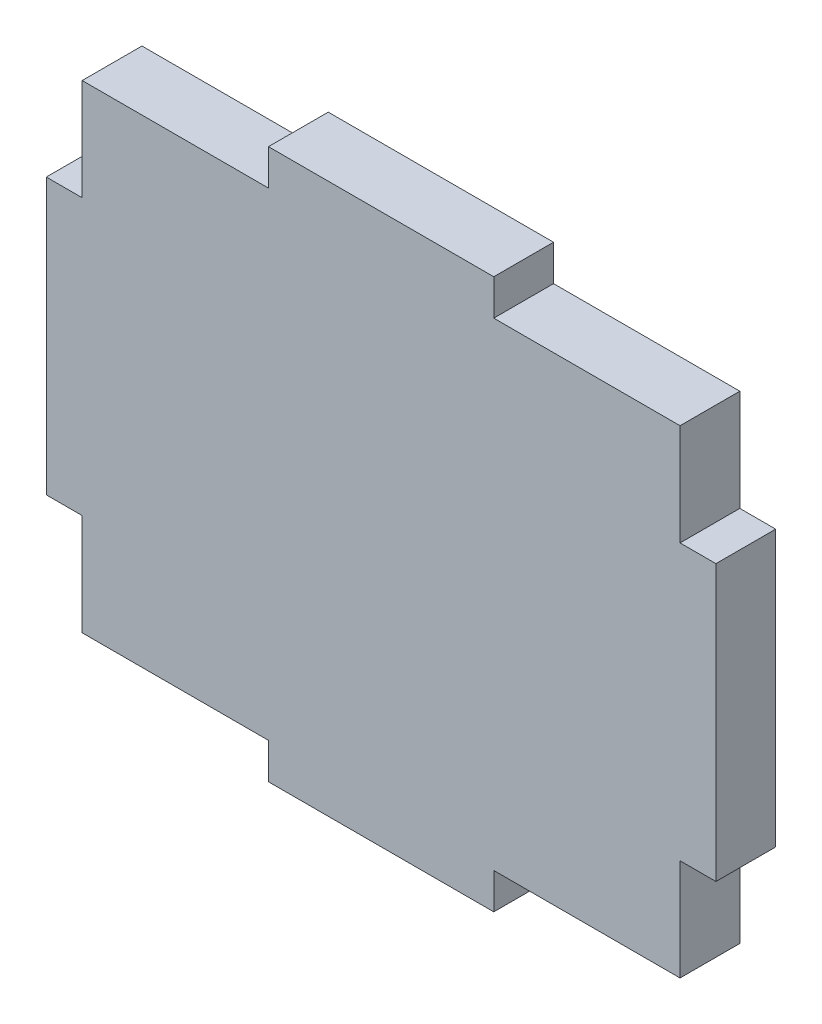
from build123d import *

# Parameters (mm, degrees)
BOSS_EXTRUDE1_DEPTH = 10


with BuildPart() as part:
    # Sketch1 → Boss-Extrude1 (new body)
    with BuildSketch(Plane.XY):
        Polygon((-50, -40), (-18.84244898, -40), (-18.84244898, -46), (18.84244898, -46), (18.84244898, -40), (50, -40), (50, -23.020408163), (56, -23.020408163), (56, 23.020408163), (50, 23.020408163), (50, 40), (18.84244898, 40), (18.84244898, 46), (-18.84244898, 46), (-18.84244898, 40), (-50, 40), (-50, 23.020408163), (-56, 23.020408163), (-56, -23.020408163), (-50, -23.020408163), align=None)
    extrude(amount=BOSS_EXTRUDE1_DEPTH)


solid = part.part
